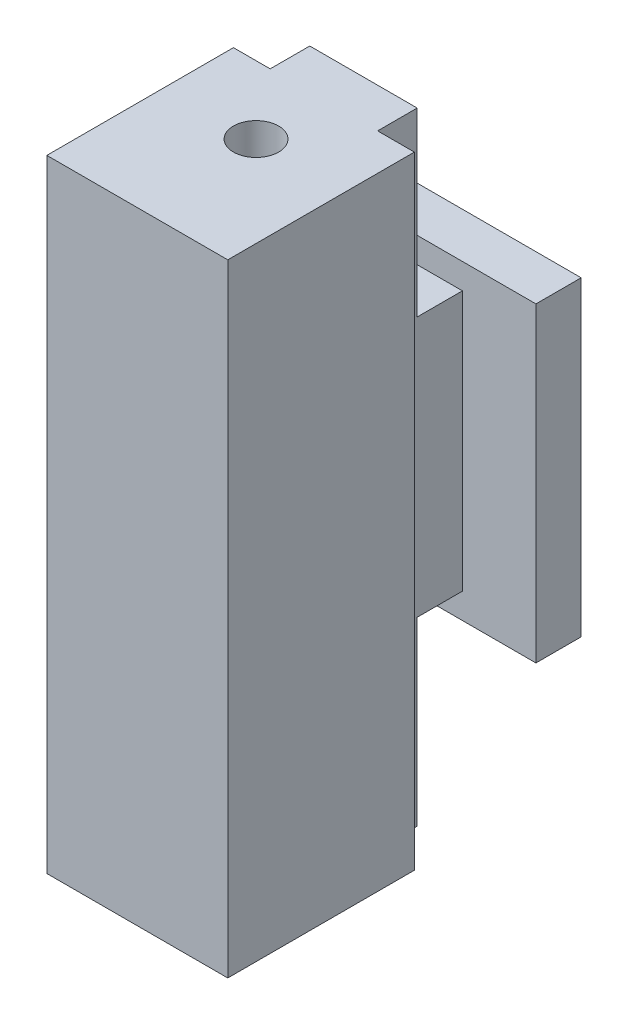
ISO-10303-21;
HEADER;
FILE_DESCRIPTION(('STEP AP214'),'2;1');
FILE_NAME('part.step','',(''),(''),'','','');
FILE_SCHEMA(('AUTOMOTIVE_DESIGN { 1 0 10303 214 1 1 1 1 }'));
ENDSEC;
DATA;
#1=APPLICATION_CONTEXT('core data for automotive mechanical design processes');
#2=APPLICATION_PROTOCOL_DEFINITION('international standard','automotive_design',2000,#1);
#3=PRODUCT_CONTEXT('',#1,'mechanical');
#4=PRODUCT('Part','Part','',(#3));
#5=PRODUCT_RELATED_PRODUCT_CATEGORY('part','',(#4));
#6=PRODUCT_DEFINITION_FORMATION('','',#4);
#7=PRODUCT_DEFINITION_CONTEXT('part definition',#1,'design');
#8=PRODUCT_DEFINITION('design','',#6,#7);
#9=PRODUCT_DEFINITION_SHAPE('','',#8);
#10=(LENGTH_UNIT() NAMED_UNIT(*) SI_UNIT(.MILLI.,.METRE.));
#11=(NAMED_UNIT(*) PLANE_ANGLE_UNIT() SI_UNIT($,.RADIAN.));
#12=(NAMED_UNIT(*) SI_UNIT($,.STERADIAN.) SOLID_ANGLE_UNIT());
#13=UNCERTAINTY_MEASURE_WITH_UNIT(LENGTH_MEASURE(1.E-05),#10,'distance_accuracy_value','');
#14=(GEOMETRIC_REPRESENTATION_CONTEXT(3) GLOBAL_UNCERTAINTY_ASSIGNED_CONTEXT((#13)) GLOBAL_UNIT_ASSIGNED_CONTEXT((#10,
#11,#12)) REPRESENTATION_CONTEXT('',''));
#15=CARTESIAN_POINT('',(0.,0.,0.));
#16=DIRECTION('',(0.,0.,1.));
#17=DIRECTION('',(1.,0.,0.));
#18=AXIS2_PLACEMENT_3D('',#15,#16,#17);
#19=CARTESIAN_POINT('',(22.5,55.,-16.));
#20=DIRECTION('',(-1.,0.,0.));
#21=DIRECTION('',(0.,-1.,0.));
#22=AXIS2_PLACEMENT_3D('',#19,#20,#21);
#23=PLANE('',#22);
#24=DIRECTION('',(0.,-1.,0.));
#25=VECTOR('',#24,1.);
#26=CARTESIAN_POINT('',(22.5,55.,-8.));
#27=LINE('',#26,#25);
#28=CARTESIAN_POINT('',(22.5,27.5,-8.));
#29=VERTEX_POINT('',#28);
#30=CARTESIAN_POINT('',(22.5,-27.5,-8.));
#31=VERTEX_POINT('',#30);
#32=EDGE_CURVE('E204',#29,#31,#27,.T.);
#33=ORIENTED_EDGE('',*,*,#32,.T.);
#34=DIRECTION('',(0.,0.,1.));
#35=VECTOR('',#34,1.);
#36=CARTESIAN_POINT('',(22.5,-27.5,-8.));
#37=LINE('',#36,#35);
#38=CARTESIAN_POINT('',(22.5,-27.5,-16.));
#39=VERTEX_POINT('',#38);
#40=EDGE_CURVE('E226',#39,#31,#37,.T.);
#41=ORIENTED_EDGE('',*,*,#40,.F.);
#42=DIRECTION('',(0.,-1.,0.));
#43=VECTOR('',#42,1.);
#44=CARTESIAN_POINT('',(22.5,55.,-16.));
#45=LINE('',#44,#43);
#46=CARTESIAN_POINT('',(22.5,27.5,-16.));
#47=VERTEX_POINT('',#46);
#48=EDGE_CURVE('E201',#47,#39,#45,.T.);
#49=ORIENTED_EDGE('',*,*,#48,.F.);
#50=DIRECTION('',(0.,0.,-1.));
#51=VECTOR('',#50,1.);
#52=CARTESIAN_POINT('',(22.5,27.5,-8.));
#53=LINE('',#52,#51);
#54=EDGE_CURVE('E252',#29,#47,#53,.T.);
#55=ORIENTED_EDGE('',*,*,#54,.F.);
#56=EDGE_LOOP('',(#33,#41,#49,#55));
#57=FACE_BOUND('',#56,.T.);
#58=ADVANCED_FACE('F14',(#57),#23,.F.);
#59=CARTESIAN_POINT('',(22.5,55.,-16.));
#60=DIRECTION('',(0.,0.,1.));
#61=DIRECTION('',(0.,1.,0.));
#62=AXIS2_PLACEMENT_3D('',#59,#60,#61);
#63=PLANE('',#62);
#64=ORIENTED_EDGE('',*,*,#48,.T.);
#65=DIRECTION('',(1.,0.,0.));
#66=VECTOR('',#65,1.);
#67=CARTESIAN_POINT('',(22.5,-27.5,-16.));
#68=LINE('',#67,#66);
#69=CARTESIAN_POINT('',(-22.5,-27.5,-16.));
#70=VERTEX_POINT('',#69);
#71=EDGE_CURVE('E234',#70,#39,#68,.T.);
#72=ORIENTED_EDGE('',*,*,#71,.F.);
#73=DIRECTION('',(0.,-1.,0.));
#74=VECTOR('',#73,1.);
#75=CARTESIAN_POINT('',(-22.5,55.,-16.));
#76=LINE('',#75,#74);
#77=CARTESIAN_POINT('',(-22.5,27.5,-16.));
#78=VERTEX_POINT('',#77);
#79=EDGE_CURVE('E198',#78,#70,#76,.T.);
#80=ORIENTED_EDGE('',*,*,#79,.F.);
#81=DIRECTION('',(-1.,0.,0.));
#82=VECTOR('',#81,1.);
#83=CARTESIAN_POINT('',(22.5,27.5,-16.));
#84=LINE('',#83,#82);
#85=EDGE_CURVE('E254',#47,#78,#84,.T.);
#86=ORIENTED_EDGE('',*,*,#85,.F.);
#87=EDGE_LOOP('',(#64,#72,#80,#86));
#88=FACE_BOUND('',#87,.T.);
#89=ADVANCED_FACE('F286',(#88),#63,.F.);
#90=CARTESIAN_POINT('',(-22.5,55.,-16.));
#91=DIRECTION('',(1.,0.,0.));
#92=DIRECTION('',(0.,1.,0.));
#93=AXIS2_PLACEMENT_3D('',#90,#91,#92);
#94=PLANE('',#93);
#95=ORIENTED_EDGE('',*,*,#79,.T.);
#96=DIRECTION('',(0.,0.,-1.));
#97=VECTOR('',#96,1.);
#98=CARTESIAN_POINT('',(-22.5,-27.5,-16.));
#99=LINE('',#98,#97);
#100=CARTESIAN_POINT('',(-22.5,-27.5,-8.));
#101=VERTEX_POINT('',#100);
#102=EDGE_CURVE('E232',#101,#70,#99,.T.);
#103=ORIENTED_EDGE('',*,*,#102,.F.);
#104=DIRECTION('',(0.,-1.,0.));
#105=VECTOR('',#104,1.);
#106=CARTESIAN_POINT('',(-22.5,55.,-8.));
#107=LINE('',#106,#105);
#108=CARTESIAN_POINT('',(-22.5,27.5,-8.));
#109=VERTEX_POINT('',#108);
#110=EDGE_CURVE('E195',#109,#101,#107,.T.);
#111=ORIENTED_EDGE('',*,*,#110,.F.);
#112=DIRECTION('',(0.,0.,1.));
#113=VECTOR('',#112,1.);
#114=CARTESIAN_POINT('',(-22.5,27.5,-16.));
#115=LINE('',#114,#113);
#116=EDGE_CURVE('E256',#78,#109,#115,.T.);
#117=ORIENTED_EDGE('',*,*,#116,.F.);
#118=EDGE_LOOP('',(#95,#103,#111,#117));
#119=FACE_BOUND('',#118,.T.);
#120=ADVANCED_FACE('F292',(#119),#94,.F.);
#121=CARTESIAN_POINT('',(-9.5,55.,-8.));
#122=DIRECTION('',(0.,0.,-1.));
#123=DIRECTION('',(0.,-1.,0.));
#124=AXIS2_PLACEMENT_3D('',#121,#122,#123);
#125=PLANE('',#124);
#126=DIRECTION('',(-1.,0.,0.));
#127=VECTOR('',#126,1.);
#128=CARTESIAN_POINT('',(-22.5,-27.5,-8.));
#129=LINE('',#128,#127);
#130=EDGE_CURVE('E230',#31,#101,#129,.T.);
#131=ORIENTED_EDGE('',*,*,#130,.F.);
#132=ORIENTED_EDGE('',*,*,#32,.F.);
#133=DIRECTION('',(1.,0.,0.));
#134=VECTOR('',#133,1.);
#135=CARTESIAN_POINT('',(-22.5,27.5,-8.));
#136=LINE('',#135,#134);
#137=EDGE_CURVE('E249',#109,#29,#136,.T.);
#138=ORIENTED_EDGE('',*,*,#137,.F.);
#139=ORIENTED_EDGE('',*,*,#110,.T.);
#140=EDGE_LOOP('',(#131,#132,#138,#139));
#141=FACE_BOUND('',#140,.T.);
#142=DIRECTION('',(0.,-1.,0.));
#143=VECTOR('',#142,1.);
#144=CARTESIAN_POINT('',(9.5,55.,-8.));
#145=LINE('',#144,#143);
#146=CARTESIAN_POINT('',(9.5,23.,-8.));
#147=VERTEX_POINT('',#146);
#148=CARTESIAN_POINT('',(9.5,-23.,-8.));
#149=VERTEX_POINT('',#148);
#150=EDGE_CURVE('E207',#147,#149,#145,.T.);
#151=ORIENTED_EDGE('',*,*,#150,.T.);
#152=DIRECTION('',(1.,0.,0.));
#153=VECTOR('',#152,1.);
#154=CARTESIAN_POINT('',(9.5,-23.,-8.));
#155=LINE('',#154,#153);
#156=CARTESIAN_POINT('',(-9.5,-23.,-8.));
#157=VERTEX_POINT('',#156);
#158=EDGE_CURVE('E147',#157,#149,#155,.T.);
#159=ORIENTED_EDGE('',*,*,#158,.F.);
#160=DIRECTION('',(0.,-1.,0.));
#161=VECTOR('',#160,1.);
#162=CARTESIAN_POINT('',(-9.5,55.,-8.));
#163=LINE('',#162,#161);
#164=CARTESIAN_POINT('',(-9.5,23.,-8.));
#165=VERTEX_POINT('',#164);
#166=EDGE_CURVE('E192',#165,#157,#163,.T.);
#167=ORIENTED_EDGE('',*,*,#166,.F.);
#168=DIRECTION('',(-1.,0.,0.));
#169=VECTOR('',#168,1.);
#170=CARTESIAN_POINT('',(9.5,23.,-8.));
#171=LINE('',#170,#169);
#172=EDGE_CURVE('E214',#147,#165,#171,.T.);
#173=ORIENTED_EDGE('',*,*,#172,.F.);
#174=EDGE_LOOP('',(#151,#159,#167,#173));
#175=FACE_BOUND('',#174,.T.);
#176=ADVANCED_FACE('F211',(#141,#175),#125,.F.);
#177=CARTESIAN_POINT('',(16.,55.,7.));
#178=DIRECTION('',(-1.,0.,0.));
#179=DIRECTION('',(0.,-1.,0.));
#180=AXIS2_PLACEMENT_3D('',#177,#178,#179);
#181=PLANE('',#180);
#182=DIRECTION('',(0.,0.,-1.));
#183=VECTOR('',#182,1.);
#184=CARTESIAN_POINT('',(16.,-55.,7.));
#185=LINE('',#184,#183);
#186=CARTESIAN_POINT('',(16.,-55.,40.));
#187=VERTEX_POINT('',#186);
#188=CARTESIAN_POINT('',(16.,-55.,7.));
#189=VERTEX_POINT('',#188);
#190=EDGE_CURVE('E158',#187,#189,#185,.T.);
#191=ORIENTED_EDGE('',*,*,#190,.T.);
#192=DIRECTION('',(0.,-1.,0.));
#193=VECTOR('',#192,1.);
#194=CARTESIAN_POINT('',(16.,55.,7.));
#195=LINE('',#194,#193);
#196=CARTESIAN_POINT('',(16.,55.,7.));
#197=VERTEX_POINT('',#196);
#198=EDGE_CURVE('E9',#197,#189,#195,.T.);
#199=ORIENTED_EDGE('',*,*,#198,.F.);
#200=DIRECTION('',(0.,0.,-1.));
#201=VECTOR('',#200,1.);
#202=CARTESIAN_POINT('',(16.,55.,7.));
#203=LINE('',#202,#201);
#204=CARTESIAN_POINT('',(16.,55.,40.));
#205=VERTEX_POINT('',#204);
#206=EDGE_CURVE('E167',#205,#197,#203,.T.);
#207=ORIENTED_EDGE('',*,*,#206,.F.);
#208=DIRECTION('',(0.,-1.,0.));
#209=VECTOR('',#208,1.);
#210=CARTESIAN_POINT('',(16.,55.,40.));
#211=LINE('',#210,#209);
#212=EDGE_CURVE('E180',#205,#187,#211,.T.);
#213=ORIENTED_EDGE('',*,*,#212,.T.);
#214=EDGE_LOOP('',(#191,#199,#207,#213));
#215=FACE_BOUND('',#214,.T.);
#216=ADVANCED_FACE('F16',(#215),#181,.F.);
#217=CARTESIAN_POINT('',(16.,55.,7.));
#218=DIRECTION('',(0.,0.,1.));
#219=DIRECTION('',(0.,1.,0.));
#220=AXIS2_PLACEMENT_3D('',#217,#218,#219);
#221=PLANE('',#220);
#222=DIRECTION('',(-1.,0.,0.));
#223=VECTOR('',#222,1.);
#224=CARTESIAN_POINT('',(16.,-55.,7.));
#225=LINE('',#224,#223);
#226=CARTESIAN_POINT('',(9.5,-55.,7.));
#227=VERTEX_POINT('',#226);
#228=EDGE_CURVE('E154',#189,#227,#225,.T.);
#229=ORIENTED_EDGE('',*,*,#228,.T.);
#230=DIRECTION('',(0.,-1.,0.));
#231=VECTOR('',#230,1.);
#232=CARTESIAN_POINT('',(9.5,55.,7.));
#233=LINE('',#232,#231);
#234=CARTESIAN_POINT('',(9.5,55.,7.));
#235=VERTEX_POINT('',#234);
#236=EDGE_CURVE('E22',#235,#227,#233,.T.);
#237=ORIENTED_EDGE('',*,*,#236,.F.);
#238=DIRECTION('',(-1.,0.,0.));
#239=VECTOR('',#238,1.);
#240=CARTESIAN_POINT('',(16.,55.,7.));
#241=LINE('',#240,#239);
#242=EDGE_CURVE('E169',#197,#235,#241,.T.);
#243=ORIENTED_EDGE('',*,*,#242,.F.);
#244=ORIENTED_EDGE('',*,*,#198,.T.);
#245=EDGE_LOOP('',(#229,#237,#243,#244));
#246=FACE_BOUND('',#245,.T.);
#247=ADVANCED_FACE('F266',(#246),#221,.F.);
#248=CARTESIAN_POINT('',(9.5,55.,-8.));
#249=DIRECTION('',(-1.,0.,0.));
#250=DIRECTION('',(0.,-1.,0.));
#251=AXIS2_PLACEMENT_3D('',#248,#249,#250);
#252=PLANE('',#251);
#253=DIRECTION('',(0.,0.,-1.));
#254=VECTOR('',#253,1.);
#255=CARTESIAN_POINT('',(9.5,-55.,-8.));
#256=LINE('',#255,#254);
#257=CARTESIAN_POINT('',(9.5,-55.,0.));
#258=VERTEX_POINT('',#257);
#259=EDGE_CURVE('E144',#227,#258,#256,.T.);
#260=ORIENTED_EDGE('',*,*,#259,.T.);
#261=DIRECTION('',(0.,-1.,0.));
#262=VECTOR('',#261,1.);
#263=CARTESIAN_POINT('',(9.5,-23.,0.));
#264=LINE('',#263,#262);
#265=CARTESIAN_POINT('',(9.5,-23.,0.));
#266=VERTEX_POINT('',#265);
#267=EDGE_CURVE('E126',#266,#258,#264,.T.);
#268=ORIENTED_EDGE('',*,*,#267,.F.);
#269=DIRECTION('',(0.,0.,1.));
#270=VECTOR('',#269,1.);
#271=CARTESIAN_POINT('',(9.5,-23.,0.));
#272=LINE('',#271,#270);
#273=EDGE_CURVE('E219',#149,#266,#272,.T.);
#274=ORIENTED_EDGE('',*,*,#273,.F.);
#275=ORIENTED_EDGE('',*,*,#150,.F.);
#276=DIRECTION('',(0.,0.,-1.));
#277=VECTOR('',#276,1.);
#278=CARTESIAN_POINT('',(9.5,23.,0.));
#279=LINE('',#278,#277);
#280=CARTESIAN_POINT('',(9.5,23.,0.));
#281=VERTEX_POINT('',#280);
#282=EDGE_CURVE('E218',#281,#147,#279,.T.);
#283=ORIENTED_EDGE('',*,*,#282,.F.);
#284=DIRECTION('',(0.,1.,0.));
#285=VECTOR('',#284,1.);
#286=CARTESIAN_POINT('',(9.5,23.,0.));
#287=LINE('',#286,#285);
#288=CARTESIAN_POINT('',(9.5,55.,0.));
#289=VERTEX_POINT('',#288);
#290=EDGE_CURVE('E247',#281,#289,#287,.T.);
#291=ORIENTED_EDGE('',*,*,#290,.T.);
#292=DIRECTION('',(0.,0.,-1.));
#293=VECTOR('',#292,1.);
#294=CARTESIAN_POINT('',(9.5,55.,-8.));
#295=LINE('',#294,#293);
#296=EDGE_CURVE('E171',#235,#289,#295,.T.);
#297=ORIENTED_EDGE('',*,*,#296,.F.);
#298=ORIENTED_EDGE('',*,*,#236,.T.);
#299=EDGE_LOOP('',(#260,#268,#274,#275,#283,#291,#297,#298));
#300=FACE_BOUND('',#299,.T.);
#301=ADVANCED_FACE('F151',(#300),#252,.F.);
#302=CARTESIAN_POINT('',(-9.5,55.,7.));
#303=DIRECTION('',(1.,0.,0.));
#304=DIRECTION('',(0.,1.,0.));
#305=AXIS2_PLACEMENT_3D('',#302,#303,#304);
#306=PLANE('',#305);
#307=DIRECTION('',(0.,0.,-1.));
#308=VECTOR('',#307,1.);
#309=CARTESIAN_POINT('',(-9.5,-23.,-8.));
#310=LINE('',#309,#308);
#311=CARTESIAN_POINT('',(-9.5,-23.,0.));
#312=VERTEX_POINT('',#311);
#313=EDGE_CURVE('E138',#312,#157,#310,.T.);
#314=ORIENTED_EDGE('',*,*,#313,.F.);
#315=DIRECTION('',(0.,-1.,0.));
#316=VECTOR('',#315,1.);
#317=CARTESIAN_POINT('',(-9.5,-23.,0.));
#318=LINE('',#317,#316);
#319=CARTESIAN_POINT('',(-9.5,-55.,0.));
#320=VERTEX_POINT('',#319);
#321=EDGE_CURVE('E137',#312,#320,#318,.T.);
#322=ORIENTED_EDGE('',*,*,#321,.T.);
#323=DIRECTION('',(0.,0.,1.));
#324=VECTOR('',#323,1.);
#325=CARTESIAN_POINT('',(-9.5,-55.,7.));
#326=LINE('',#325,#324);
#327=CARTESIAN_POINT('',(-9.5,-55.,7.));
#328=VERTEX_POINT('',#327);
#329=EDGE_CURVE('E146',#320,#328,#326,.T.);
#330=ORIENTED_EDGE('',*,*,#329,.T.);
#331=DIRECTION('',(0.,-1.,0.));
#332=VECTOR('',#331,1.);
#333=CARTESIAN_POINT('',(-9.5,55.,7.));
#334=LINE('',#333,#332);
#335=CARTESIAN_POINT('',(-9.5,55.,7.));
#336=VERTEX_POINT('',#335);
#337=EDGE_CURVE('E189',#336,#328,#334,.T.);
#338=ORIENTED_EDGE('',*,*,#337,.F.);
#339=DIRECTION('',(0.,0.,1.));
#340=VECTOR('',#339,1.);
#341=CARTESIAN_POINT('',(-9.5,55.,7.));
#342=LINE('',#341,#340);
#343=CARTESIAN_POINT('',(-9.5,55.,0.));
#344=VERTEX_POINT('',#343);
#345=EDGE_CURVE('E174',#344,#336,#342,.T.);
#346=ORIENTED_EDGE('',*,*,#345,.F.);
#347=DIRECTION('',(0.,1.,0.));
#348=VECTOR('',#347,1.);
#349=CARTESIAN_POINT('',(-9.5,23.,0.));
#350=LINE('',#349,#348);
#351=CARTESIAN_POINT('',(-9.5,23.,0.));
#352=VERTEX_POINT('',#351);
#353=EDGE_CURVE('E246',#352,#344,#350,.T.);
#354=ORIENTED_EDGE('',*,*,#353,.F.);
#355=DIRECTION('',(0.,0.,1.));
#356=VECTOR('',#355,1.);
#357=CARTESIAN_POINT('',(-9.5,23.,-8.));
#358=LINE('',#357,#356);
#359=EDGE_CURVE('E239',#165,#352,#358,.T.);
#360=ORIENTED_EDGE('',*,*,#359,.F.);
#361=ORIENTED_EDGE('',*,*,#166,.T.);
#362=EDGE_LOOP('',(#314,#322,#330,#338,#346,#354,#360,#361));
#363=FACE_BOUND('',#362,.T.);
#364=ADVANCED_FACE('F298',(#363),#306,.F.);
#365=CARTESIAN_POINT('',(-9.5,55.,7.));
#366=DIRECTION('',(0.,0.,1.));
#367=DIRECTION('',(0.,1.,0.));
#368=AXIS2_PLACEMENT_3D('',#365,#366,#367);
#369=PLANE('',#368);
#370=DIRECTION('',(-1.,0.,0.));
#371=VECTOR('',#370,1.);
#372=CARTESIAN_POINT('',(-9.5,-55.,7.));
#373=LINE('',#372,#371);
#374=CARTESIAN_POINT('',(-16.,-55.,7.));
#375=VERTEX_POINT('',#374);
#376=EDGE_CURVE('E156',#328,#375,#373,.T.);
#377=ORIENTED_EDGE('',*,*,#376,.T.);
#378=DIRECTION('',(0.,-1.,0.));
#379=VECTOR('',#378,1.);
#380=CARTESIAN_POINT('',(-16.,55.,7.));
#381=LINE('',#380,#379);
#382=CARTESIAN_POINT('',(-16.,55.,7.));
#383=VERTEX_POINT('',#382);
#384=EDGE_CURVE('E186',#383,#375,#381,.T.);
#385=ORIENTED_EDGE('',*,*,#384,.F.);
#386=DIRECTION('',(-1.,0.,0.));
#387=VECTOR('',#386,1.);
#388=CARTESIAN_POINT('',(-9.5,55.,7.));
#389=LINE('',#388,#387);
#390=EDGE_CURVE('E176',#336,#383,#389,.T.);
#391=ORIENTED_EDGE('',*,*,#390,.F.);
#392=ORIENTED_EDGE('',*,*,#337,.T.);
#393=EDGE_LOOP('',(#377,#385,#391,#392));
#394=FACE_BOUND('',#393,.T.);
#395=ADVANCED_FACE('F315',(#394),#369,.F.);
#396=CARTESIAN_POINT('',(-16.,55.,7.));
#397=DIRECTION('',(1.,0.,0.));
#398=DIRECTION('',(0.,1.,0.));
#399=AXIS2_PLACEMENT_3D('',#396,#397,#398);
#400=PLANE('',#399);
#401=DIRECTION('',(0.,0.,1.));
#402=VECTOR('',#401,1.);
#403=CARTESIAN_POINT('',(-16.,-55.,7.));
#404=LINE('',#403,#402);
#405=CARTESIAN_POINT('',(-16.,-55.,40.));
#406=VERTEX_POINT('',#405);
#407=EDGE_CURVE('E163',#375,#406,#404,.T.);
#408=ORIENTED_EDGE('',*,*,#407,.T.);
#409=DIRECTION('',(0.,-1.,0.));
#410=VECTOR('',#409,1.);
#411=CARTESIAN_POINT('',(-16.,55.,40.));
#412=LINE('',#411,#410);
#413=CARTESIAN_POINT('',(-16.,55.,40.));
#414=VERTEX_POINT('',#413);
#415=EDGE_CURVE('E183',#414,#406,#412,.T.);
#416=ORIENTED_EDGE('',*,*,#415,.F.);
#417=DIRECTION('',(0.,0.,1.));
#418=VECTOR('',#417,1.);
#419=CARTESIAN_POINT('',(-16.,55.,7.));
#420=LINE('',#419,#418);
#421=EDGE_CURVE('E34',#383,#414,#420,.T.);
#422=ORIENTED_EDGE('',*,*,#421,.F.);
#423=ORIENTED_EDGE('',*,*,#384,.T.);
#424=EDGE_LOOP('',(#408,#416,#422,#423));
#425=FACE_BOUND('',#424,.T.);
#426=ADVANCED_FACE('F281',(#425),#400,.F.);
#427=CARTESIAN_POINT('',(16.,55.,40.));
#428=DIRECTION('',(0.,0.,-1.));
#429=DIRECTION('',(0.,-1.,0.));
#430=AXIS2_PLACEMENT_3D('',#427,#428,#429);
#431=PLANE('',#430);
#432=DIRECTION('',(1.,0.,0.));
#433=VECTOR('',#432,1.);
#434=CARTESIAN_POINT('',(16.,-55.,40.));
#435=LINE('',#434,#433);
#436=EDGE_CURVE('E165',#406,#187,#435,.T.);
#437=ORIENTED_EDGE('',*,*,#436,.T.);
#438=ORIENTED_EDGE('',*,*,#212,.F.);
#439=DIRECTION('',(1.,0.,0.));
#440=VECTOR('',#439,1.);
#441=CARTESIAN_POINT('',(16.,55.,40.));
#442=LINE('',#441,#440);
#443=EDGE_CURVE('E29',#414,#205,#442,.T.);
#444=ORIENTED_EDGE('',*,*,#443,.F.);
#445=ORIENTED_EDGE('',*,*,#415,.T.);
#446=EDGE_LOOP('',(#437,#438,#444,#445));
#447=FACE_BOUND('',#446,.T.);
#448=ADVANCED_FACE('F270',(#447),#431,.F.);
#449=CARTESIAN_POINT('',(16.,55.,40.));
#450=DIRECTION('',(0.,-1.,0.));
#451=DIRECTION('',(1.,0.,0.));
#452=AXIS2_PLACEMENT_3D('',#449,#450,#451);
#453=PLANE('',#452);
#454=CARTESIAN_POINT('',(0.,55.,19.));
#455=DIRECTION('',(0.,1.,0.));
#456=DIRECTION('',(0.,0.,-1.));
#457=AXIS2_PLACEMENT_3D('',#454,#455,#456);
#458=CIRCLE('',#457,4.);
#459=CARTESIAN_POINT('',(0.,55.,15.));
#460=VERTEX_POINT('',#459);
#461=EDGE_CURVE('E374',#460,#460,#458,.T.);
#462=ORIENTED_EDGE('',*,*,#461,.F.);
#463=EDGE_LOOP('',(#462));
#464=FACE_BOUND('',#463,.T.);
#465=ORIENTED_EDGE('',*,*,#296,.T.);
#466=DIRECTION('',(1.,0.,0.));
#467=VECTOR('',#466,1.);
#468=CARTESIAN_POINT('',(9.5,55.,0.));
#469=LINE('',#468,#467);
#470=EDGE_CURVE('E236',#344,#289,#469,.T.);
#471=ORIENTED_EDGE('',*,*,#470,.F.);
#472=ORIENTED_EDGE('',*,*,#345,.T.);
#473=ORIENTED_EDGE('',*,*,#390,.T.);
#474=ORIENTED_EDGE('',*,*,#421,.T.);
#475=ORIENTED_EDGE('',*,*,#443,.T.);
#476=ORIENTED_EDGE('',*,*,#206,.T.);
#477=ORIENTED_EDGE('',*,*,#242,.T.);
#478=EDGE_LOOP('',(#465,#471,#472,#473,#474,#475,#476,#477));
#479=FACE_BOUND('',#478,.T.);
#480=ADVANCED_FACE('F267',(#464,#479),#453,.F.);
#481=CARTESIAN_POINT('',(16.,-55.,40.));
#482=DIRECTION('',(0.,-1.,0.));
#483=DIRECTION('',(1.,0.,0.));
#484=AXIS2_PLACEMENT_3D('',#481,#482,#483);
#485=PLANE('',#484);
#486=CARTESIAN_POINT('',(0.,-55.,19.));
#487=DIRECTION('',(0.,-1.,0.));
#488=DIRECTION('',(0.,0.,1.));
#489=AXIS2_PLACEMENT_3D('',#486,#487,#488);
#490=CIRCLE('',#489,4.);
#491=CARTESIAN_POINT('',(0.,-55.,23.));
#492=VERTEX_POINT('',#491);
#493=EDGE_CURVE('E375',#492,#492,#490,.T.);
#494=ORIENTED_EDGE('',*,*,#493,.F.);
#495=EDGE_LOOP('',(#494));
#496=FACE_BOUND('',#495,.T.);
#497=DIRECTION('',(-1.,0.,0.));
#498=VECTOR('',#497,1.);
#499=CARTESIAN_POINT('',(-9.5,-55.,0.));
#500=LINE('',#499,#498);
#501=EDGE_CURVE('E129',#258,#320,#500,.T.);
#502=ORIENTED_EDGE('',*,*,#501,.F.);
#503=ORIENTED_EDGE('',*,*,#259,.F.);
#504=ORIENTED_EDGE('',*,*,#228,.F.);
#505=ORIENTED_EDGE('',*,*,#190,.F.);
#506=ORIENTED_EDGE('',*,*,#436,.F.);
#507=ORIENTED_EDGE('',*,*,#407,.F.);
#508=ORIENTED_EDGE('',*,*,#376,.F.);
#509=ORIENTED_EDGE('',*,*,#329,.F.);
#510=EDGE_LOOP('',(#502,#503,#504,#505,#506,#507,#508,#509));
#511=FACE_BOUND('',#510,.T.);
#512=ADVANCED_FACE('F143',(#496,#511),#485,.T.);
#513=CARTESIAN_POINT('',(22.5,27.5,-8.));
#514=DIRECTION('',(0.,1.,0.));
#515=DIRECTION('',(-1.,0.,0.));
#516=AXIS2_PLACEMENT_3D('',#513,#514,#515);
#517=PLANE('',#516);
#518=ORIENTED_EDGE('',*,*,#116,.T.);
#519=ORIENTED_EDGE('',*,*,#137,.T.);
#520=ORIENTED_EDGE('',*,*,#54,.T.);
#521=ORIENTED_EDGE('',*,*,#85,.T.);
#522=EDGE_LOOP('',(#518,#519,#520,#521));
#523=FACE_BOUND('',#522,.T.);
#524=ADVANCED_FACE('F278',(#523),#517,.T.);
#525=CARTESIAN_POINT('',(9.5,23.,0.));
#526=DIRECTION('',(0.,0.,1.));
#527=DIRECTION('',(0.,1.,0.));
#528=AXIS2_PLACEMENT_3D('',#525,#526,#527);
#529=PLANE('',#528);
#530=ORIENTED_EDGE('',*,*,#470,.T.);
#531=ORIENTED_EDGE('',*,*,#290,.F.);
#532=DIRECTION('',(1.,0.,0.));
#533=VECTOR('',#532,1.);
#534=CARTESIAN_POINT('',(9.5,23.,0.));
#535=LINE('',#534,#533);
#536=EDGE_CURVE('E242',#352,#281,#535,.T.);
#537=ORIENTED_EDGE('',*,*,#536,.F.);
#538=ORIENTED_EDGE('',*,*,#353,.T.);
#539=EDGE_LOOP('',(#530,#531,#537,#538));
#540=FACE_BOUND('',#539,.T.);
#541=ADVANCED_FACE('F335',(#540),#529,.F.);
#542=CARTESIAN_POINT('',(-9.5,23.,-8.));
#543=DIRECTION('',(0.,1.,0.));
#544=DIRECTION('',(-1.,0.,0.));
#545=AXIS2_PLACEMENT_3D('',#542,#543,#544);
#546=PLANE('',#545);
#547=ORIENTED_EDGE('',*,*,#172,.T.);
#548=ORIENTED_EDGE('',*,*,#359,.T.);
#549=ORIENTED_EDGE('',*,*,#536,.T.);
#550=ORIENTED_EDGE('',*,*,#282,.T.);
#551=EDGE_LOOP('',(#547,#548,#549,#550));
#552=FACE_BOUND('',#551,.T.);
#553=ADVANCED_FACE('F333',(#552),#546,.T.);
#554=CARTESIAN_POINT('',(22.5,-27.5,-16.));
#555=DIRECTION('',(0.,1.,0.));
#556=DIRECTION('',(-1.,0.,0.));
#557=AXIS2_PLACEMENT_3D('',#554,#555,#556);
#558=PLANE('',#557);
#559=ORIENTED_EDGE('',*,*,#40,.T.);
#560=ORIENTED_EDGE('',*,*,#130,.T.);
#561=ORIENTED_EDGE('',*,*,#102,.T.);
#562=ORIENTED_EDGE('',*,*,#71,.T.);
#563=EDGE_LOOP('',(#559,#560,#561,#562));
#564=FACE_BOUND('',#563,.T.);
#565=ADVANCED_FACE('F342',(#564),#558,.F.);
#566=CARTESIAN_POINT('',(-9.5,-23.,0.));
#567=DIRECTION('',(0.,0.,1.));
#568=DIRECTION('',(0.,1.,0.));
#569=AXIS2_PLACEMENT_3D('',#566,#567,#568);
#570=PLANE('',#569);
#571=ORIENTED_EDGE('',*,*,#501,.T.);
#572=ORIENTED_EDGE('',*,*,#321,.F.);
#573=DIRECTION('',(-1.,0.,0.));
#574=VECTOR('',#573,1.);
#575=CARTESIAN_POINT('',(-9.5,-23.,0.));
#576=LINE('',#575,#574);
#577=EDGE_CURVE('E132',#266,#312,#576,.T.);
#578=ORIENTED_EDGE('',*,*,#577,.F.);
#579=ORIENTED_EDGE('',*,*,#267,.T.);
#580=EDGE_LOOP('',(#571,#572,#578,#579));
#581=FACE_BOUND('',#580,.T.);
#582=ADVANCED_FACE('F128',(#581),#570,.F.);
#583=CARTESIAN_POINT('',(-9.5,-23.,-8.));
#584=DIRECTION('',(0.,1.,0.));
#585=DIRECTION('',(-1.,0.,0.));
#586=AXIS2_PLACEMENT_3D('',#583,#584,#585);
#587=PLANE('',#586);
#588=ORIENTED_EDGE('',*,*,#158,.T.);
#589=ORIENTED_EDGE('',*,*,#273,.T.);
#590=ORIENTED_EDGE('',*,*,#577,.T.);
#591=ORIENTED_EDGE('',*,*,#313,.T.);
#592=EDGE_LOOP('',(#588,#589,#590,#591));
#593=FACE_BOUND('',#592,.T.);
#594=ADVANCED_FACE('F330',(#593),#587,.F.);
#595=CARTESIAN_POINT('',(0.,40.,19.));
#596=DIRECTION('',(0.,1.,0.));
#597=DIRECTION('',(0.,0.,-1.));
#598=AXIS2_PLACEMENT_3D('',#595,#596,#597);
#599=PLANE('',#598);
#600=CARTESIAN_POINT('',(0.,40.,19.));
#601=DIRECTION('',(0.,1.,0.));
#602=DIRECTION('',(0.,0.,-1.));
#603=AXIS2_PLACEMENT_3D('',#600,#601,#602);
#604=CIRCLE('',#603,4.);
#605=CARTESIAN_POINT('',(0.,40.,15.));
#606=VERTEX_POINT('',#605);
#607=EDGE_CURVE('E148',#606,#606,#604,.T.);
#608=ORIENTED_EDGE('',*,*,#607,.T.);
#609=EDGE_LOOP('',(#608));
#610=FACE_BOUND('',#609,.T.);
#611=ADVANCED_FACE('F354',(#610),#599,.T.);
#612=CARTESIAN_POINT('',(0.,40.,19.));
#613=DIRECTION('',(0.,1.,0.));
#614=DIRECTION('',(0.,0.,-1.));
#615=AXIS2_PLACEMENT_3D('',#612,#613,#614);
#616=CYLINDRICAL_SURFACE('',#615,4.);
#617=ORIENTED_EDGE('',*,*,#607,.F.);
#618=EDGE_LOOP('',(#617));
#619=FACE_BOUND('',#618,.T.);
#620=ORIENTED_EDGE('',*,*,#461,.T.);
#621=EDGE_LOOP('',(#620));
#622=FACE_BOUND('',#621,.T.);
#623=ADVANCED_FACE('F355',(#619,#622),#616,.F.);
#624=CARTESIAN_POINT('',(0.,-40.,19.));
#625=DIRECTION('',(0.,-1.,0.));
#626=DIRECTION('',(0.,0.,1.));
#627=AXIS2_PLACEMENT_3D('',#624,#625,#626);
#628=PLANE('',#627);
#629=CARTESIAN_POINT('',(0.,-40.,19.));
#630=DIRECTION('',(0.,-1.,0.));
#631=DIRECTION('',(0.,0.,1.));
#632=AXIS2_PLACEMENT_3D('',#629,#630,#631);
#633=CIRCLE('',#632,4.);
#634=CARTESIAN_POINT('',(0.,-40.,23.));
#635=VERTEX_POINT('',#634);
#636=EDGE_CURVE('E373',#635,#635,#633,.T.);
#637=ORIENTED_EDGE('',*,*,#636,.T.);
#638=EDGE_LOOP('',(#637));
#639=FACE_BOUND('',#638,.T.);
#640=ADVANCED_FACE('F358',(#639),#628,.T.);
#641=CARTESIAN_POINT('',(0.,-40.,19.));
#642=DIRECTION('',(0.,-1.,0.));
#643=DIRECTION('',(0.,0.,1.));
#644=AXIS2_PLACEMENT_3D('',#641,#642,#643);
#645=CYLINDRICAL_SURFACE('',#644,4.);
#646=ORIENTED_EDGE('',*,*,#636,.F.);
#647=EDGE_LOOP('',(#646));
#648=FACE_BOUND('',#647,.T.);
#649=ORIENTED_EDGE('',*,*,#493,.T.);
#650=EDGE_LOOP('',(#649));
#651=FACE_BOUND('',#650,.T.);
#652=ADVANCED_FACE('F363',(#648,#651),#645,.F.);
#653=CLOSED_SHELL('',(#58,#89,#120,#176,#216,#247,#301,#364,#395,#426,#448,#480,#512,#524,#541,
#553,#565,#582,#594,#611,#623,#640,#652));
#654=MANIFOLD_SOLID_BREP('B1',#653);
#655=ADVANCED_BREP_SHAPE_REPRESENTATION('',(#18,#654),#14);
#656=SHAPE_DEFINITION_REPRESENTATION(#9,#655);
ENDSEC;
END-ISO-10303-21;
